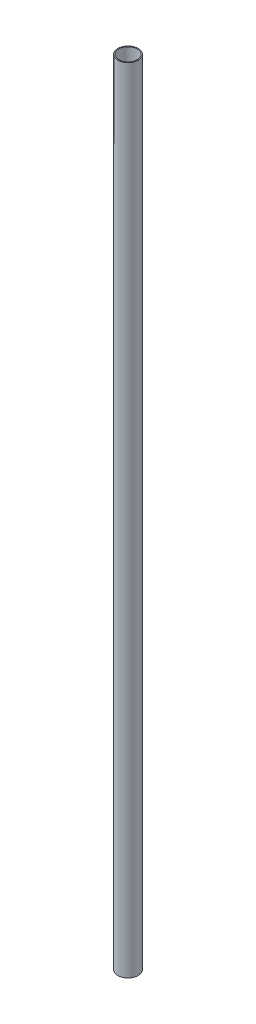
ISO-10303-21;
HEADER;
FILE_DESCRIPTION(('STEP AP214'),'2;1');
FILE_NAME('part.step','',(''),(''),'','','');
FILE_SCHEMA(('AUTOMOTIVE_DESIGN { 1 0 10303 214 1 1 1 1 }'));
ENDSEC;
DATA;
#1=APPLICATION_CONTEXT('core data for automotive mechanical design processes');
#2=APPLICATION_PROTOCOL_DEFINITION('international standard','automotive_design',2000,#1);
#3=PRODUCT_CONTEXT('',#1,'mechanical');
#4=PRODUCT('Part','Part','',(#3));
#5=PRODUCT_RELATED_PRODUCT_CATEGORY('part','',(#4));
#6=PRODUCT_DEFINITION_FORMATION('','',#4);
#7=PRODUCT_DEFINITION_CONTEXT('part definition',#1,'design');
#8=PRODUCT_DEFINITION('design','',#6,#7);
#9=PRODUCT_DEFINITION_SHAPE('','',#8);
#10=(LENGTH_UNIT() NAMED_UNIT(*) SI_UNIT(.MILLI.,.METRE.));
#11=(NAMED_UNIT(*) PLANE_ANGLE_UNIT() SI_UNIT($,.RADIAN.));
#12=(NAMED_UNIT(*) SI_UNIT($,.STERADIAN.) SOLID_ANGLE_UNIT());
#13=UNCERTAINTY_MEASURE_WITH_UNIT(LENGTH_MEASURE(1.E-05),#10,'distance_accuracy_value','');
#14=(GEOMETRIC_REPRESENTATION_CONTEXT(3) GLOBAL_UNCERTAINTY_ASSIGNED_CONTEXT((#13)) GLOBAL_UNIT_ASSIGNED_CONTEXT((#10,
#11,#12)) REPRESENTATION_CONTEXT('',''));
#15=CARTESIAN_POINT('',(0.,0.,0.));
#16=DIRECTION('',(0.,0.,1.));
#17=DIRECTION('',(1.,0.,0.));
#18=AXIS2_PLACEMENT_3D('',#15,#16,#17);
#19=CARTESIAN_POINT('',(0.,854.508754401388,0.));
#20=DIRECTION('',(0.,-1.,0.));
#21=DIRECTION('',(0.,0.,-1.));
#22=AXIS2_PLACEMENT_3D('',#19,#20,#21);
#23=CYLINDRICAL_SURFACE('',#22,10.);
#24=CARTESIAN_POINT('',(0.,854.508754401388,0.));
#25=DIRECTION('',(0.,1.,0.));
#26=DIRECTION('',(0.,0.,1.));
#27=AXIS2_PLACEMENT_3D('',#24,#25,#26);
#28=CIRCLE('',#27,10.);
#29=CARTESIAN_POINT('',(0.,854.508754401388,10.));
#30=VERTEX_POINT('',#29);
#31=EDGE_CURVE('E36',#30,#30,#28,.T.);
#32=ORIENTED_EDGE('',*,*,#31,.T.);
#33=EDGE_LOOP('',(#32));
#34=FACE_BOUND('',#33,.T.);
#35=CARTESIAN_POINT('',(0.,0.,0.));
#36=DIRECTION('',(0.,1.,0.));
#37=DIRECTION('',(0.,0.,1.));
#38=AXIS2_PLACEMENT_3D('',#35,#36,#37);
#39=CIRCLE('',#38,10.);
#40=CARTESIAN_POINT('',(0.,0.,10.));
#41=VERTEX_POINT('',#40);
#42=EDGE_CURVE('E42',#41,#41,#39,.T.);
#43=ORIENTED_EDGE('',*,*,#42,.F.);
#44=EDGE_LOOP('',(#43));
#45=FACE_BOUND('',#44,.T.);
#46=ADVANCED_FACE('F29',(#34,#45),#23,.F.);
#47=CARTESIAN_POINT('',(0.,854.508754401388,0.));
#48=DIRECTION('',(0.,-1.,0.));
#49=DIRECTION('',(0.,0.,-1.));
#50=AXIS2_PLACEMENT_3D('',#47,#48,#49);
#51=CYLINDRICAL_SURFACE('',#50,11.);
#52=CARTESIAN_POINT('',(0.,854.508754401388,0.));
#53=DIRECTION('',(0.,1.,0.));
#54=DIRECTION('',(0.,0.,1.));
#55=AXIS2_PLACEMENT_3D('',#52,#53,#54);
#56=CIRCLE('',#55,11.);
#57=CARTESIAN_POINT('',(0.,854.508754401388,11.));
#58=VERTEX_POINT('',#57);
#59=EDGE_CURVE('E10',#58,#58,#56,.T.);
#60=ORIENTED_EDGE('',*,*,#59,.F.);
#61=EDGE_LOOP('',(#60));
#62=FACE_BOUND('',#61,.T.);
#63=CARTESIAN_POINT('',(0.,0.,0.));
#64=DIRECTION('',(0.,1.,0.));
#65=DIRECTION('',(0.,0.,1.));
#66=AXIS2_PLACEMENT_3D('',#63,#64,#65);
#67=CIRCLE('',#66,11.);
#68=CARTESIAN_POINT('',(0.,0.,11.));
#69=VERTEX_POINT('',#68);
#70=EDGE_CURVE('E32',#69,#69,#67,.T.);
#71=ORIENTED_EDGE('',*,*,#70,.T.);
#72=EDGE_LOOP('',(#71));
#73=FACE_BOUND('',#72,.T.);
#74=ADVANCED_FACE('F49',(#62,#73),#51,.T.);
#75=CARTESIAN_POINT('',(0.,854.508754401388,0.));
#76=DIRECTION('',(0.,1.,0.));
#77=DIRECTION('',(0.,0.,1.));
#78=AXIS2_PLACEMENT_3D('',#75,#76,#77);
#79=PLANE('',#78);
#80=ORIENTED_EDGE('',*,*,#31,.F.);
#81=EDGE_LOOP('',(#80));
#82=FACE_BOUND('',#81,.T.);
#83=ORIENTED_EDGE('',*,*,#59,.T.);
#84=EDGE_LOOP('',(#83));
#85=FACE_BOUND('',#84,.T.);
#86=ADVANCED_FACE('F53',(#82,#85),#79,.T.);
#87=CARTESIAN_POINT('',(0.,0.,0.));
#88=DIRECTION('',(0.,1.,0.));
#89=DIRECTION('',(0.,0.,1.));
#90=AXIS2_PLACEMENT_3D('',#87,#88,#89);
#91=PLANE('',#90);
#92=ORIENTED_EDGE('',*,*,#42,.T.);
#93=EDGE_LOOP('',(#92));
#94=FACE_BOUND('',#93,.T.);
#95=ORIENTED_EDGE('',*,*,#70,.F.);
#96=EDGE_LOOP('',(#95));
#97=FACE_BOUND('',#96,.T.);
#98=ADVANCED_FACE('F51',(#94,#97),#91,.F.);
#99=CLOSED_SHELL('',(#46,#74,#86,#98));
#100=MANIFOLD_SOLID_BREP('B2',#99);
#101=ADVANCED_BREP_SHAPE_REPRESENTATION('',(#18,#100),#14);
#102=SHAPE_DEFINITION_REPRESENTATION(#9,#101);
ENDSEC;
END-ISO-10303-21;
